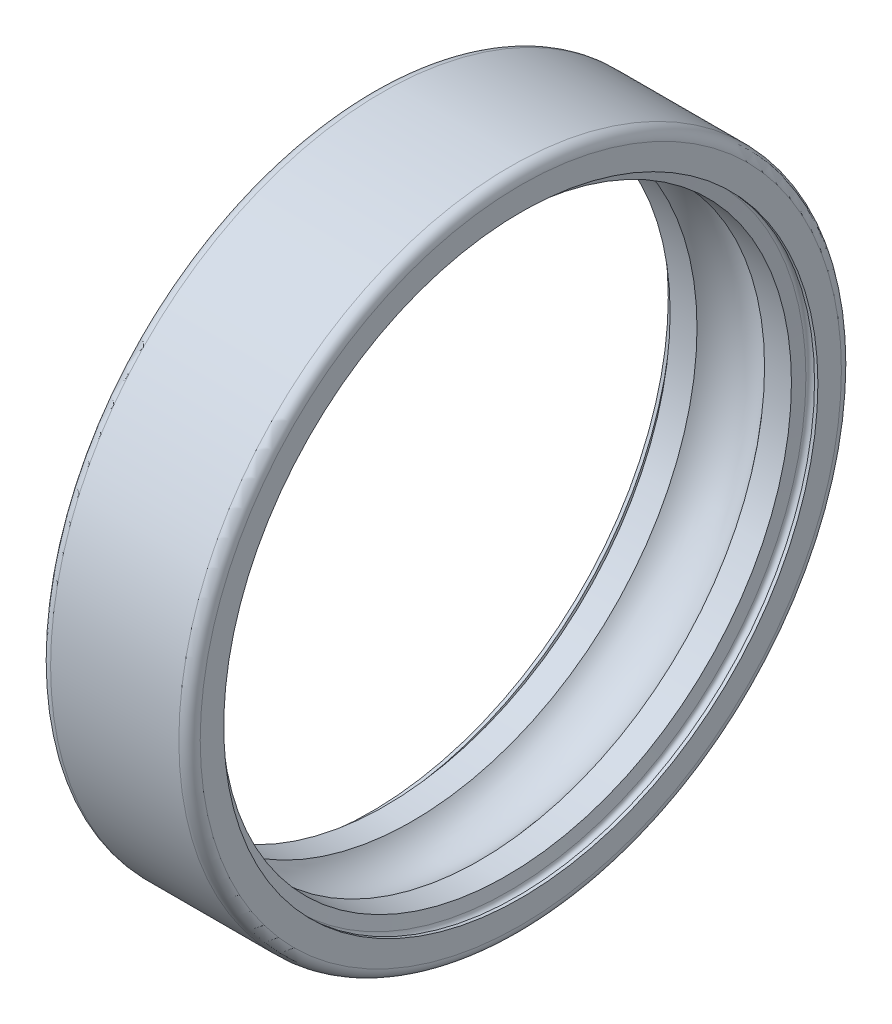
from build123d import *


with BuildPart() as part:
    # Esquisse1 → R_volution1 (revolve)
    with BuildSketch(Plane.XY, mode=Mode.PRIVATE) as r_volution1_sk:
        with BuildLine():
            Line((0, 30), (0, 27.8))
            Line((0, 27.8), (0.314222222, 27.8))
            ThreePointArc((0.314222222, 27.8), (0.718222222, 28.204), (1.122222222, 27.8))
            Line((1.122222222, 27.8), (1.32499825, 26.65))
            Line((1.32499825, 26.65), (3.838835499, 26.65))
            ThreePointArc((3.838835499, 26.65), (7, 28.219), (10.161164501, 26.65))
            Line((10.161164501, 26.65), (12.67500175, 26.65))
            Line((12.67500175, 26.65), (12.877777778, 27.8))
            ThreePointArc((12.877777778, 27.8), (13.281777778, 28.204), (13.685777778, 27.8))
            Line((13.685777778, 27.8), (14, 27.8))
            Line((14, 27.8), (14, 30))
            ThreePointArc((14, 30), (13.707106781, 30.707106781), (13, 31))
            Line((13, 31), (1, 31))
            ThreePointArc((1, 31), (0.292893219, 30.707106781), (0, 30))
        make_face()
    revolve(r_volution1_sk.sketch.rotate(Axis((13, 0, 0), (-1, 0, 0)), 90), axis=Axis((13, 0, 0), (-1, 0, 0)))


solid = part.part
